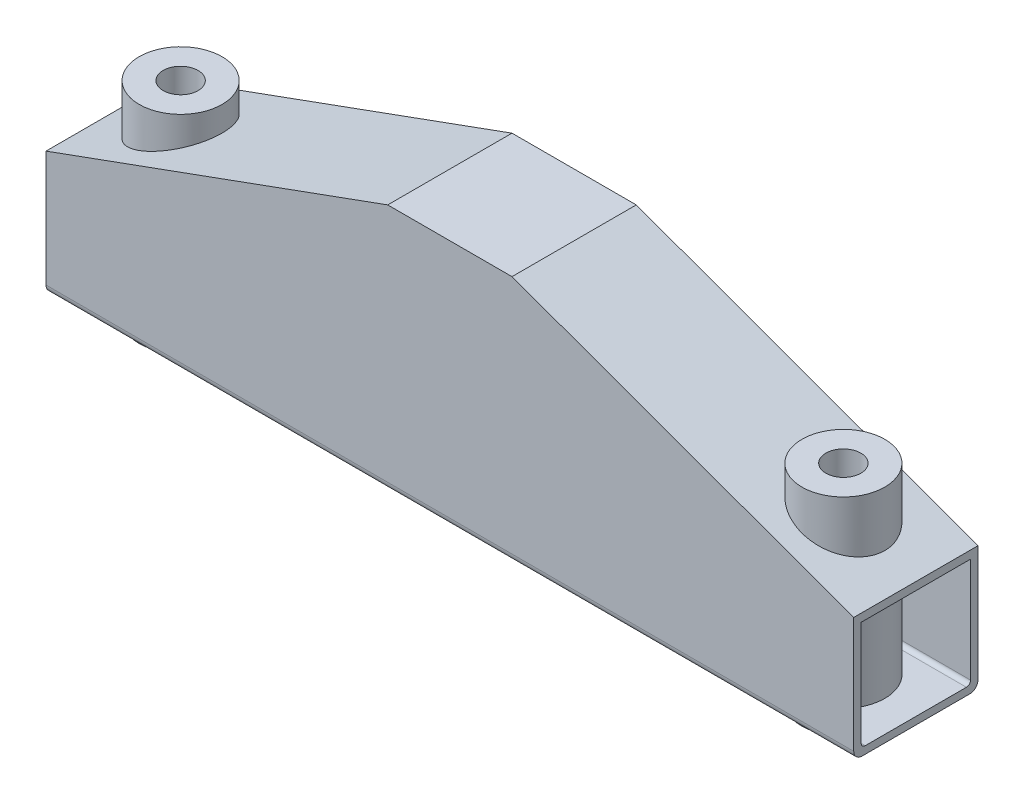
ISO-10303-21;
HEADER;
FILE_DESCRIPTION(('STEP AP214'),'2;1');
FILE_NAME('part.step','',(''),(''),'','','');
FILE_SCHEMA(('AUTOMOTIVE_DESIGN { 1 0 10303 214 1 1 1 1 }'));
ENDSEC;
DATA;
#1=APPLICATION_CONTEXT('core data for automotive mechanical design processes');
#2=APPLICATION_PROTOCOL_DEFINITION('international standard','automotive_design',2000,#1);
#3=PRODUCT_CONTEXT('',#1,'mechanical');
#4=PRODUCT('Part','Part','',(#3));
#5=PRODUCT_RELATED_PRODUCT_CATEGORY('part','',(#4));
#6=PRODUCT_DEFINITION_FORMATION('','',#4);
#7=PRODUCT_DEFINITION_CONTEXT('part definition',#1,'design');
#8=PRODUCT_DEFINITION('design','',#6,#7);
#9=PRODUCT_DEFINITION_SHAPE('','',#8);
#10=(LENGTH_UNIT() NAMED_UNIT(*) SI_UNIT(.MILLI.,.METRE.));
#11=(NAMED_UNIT(*) PLANE_ANGLE_UNIT() SI_UNIT($,.RADIAN.));
#12=(NAMED_UNIT(*) SI_UNIT($,.STERADIAN.) SOLID_ANGLE_UNIT());
#13=UNCERTAINTY_MEASURE_WITH_UNIT(LENGTH_MEASURE(1.E-05),#10,'distance_accuracy_value','');
#14=(GEOMETRIC_REPRESENTATION_CONTEXT(3) GLOBAL_UNCERTAINTY_ASSIGNED_CONTEXT((#13)) GLOBAL_UNIT_ASSIGNED_CONTEXT((#10,
#11,#12)) REPRESENTATION_CONTEXT('',''));
#15=CARTESIAN_POINT('',(0.,0.,0.));
#16=DIRECTION('',(0.,0.,1.));
#17=DIRECTION('',(1.,0.,0.));
#18=AXIS2_PLACEMENT_3D('',#15,#16,#17);
#19=CARTESIAN_POINT('',(-19.05,36.83,-25.4));
#20=DIRECTION('',(0.341743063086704,-0.939793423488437,0.));
#21=DIRECTION('',(0.939793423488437,0.341743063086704,0.));
#22=AXIS2_PLACEMENT_3D('',#19,#20,#21);
#23=PLANE('',#22);
#24=DIRECTION('',(0.,0.,1.));
#25=VECTOR('',#24,1.);
#26=CARTESIAN_POINT('',(-19.05,36.83,-25.4));
#27=LINE('',#26,#25);
#28=CARTESIAN_POINT('',(-19.05,36.83,-19.05));
#29=VERTEX_POINT('',#28);
#30=CARTESIAN_POINT('',(-19.05,36.83,19.05));
#31=VERTEX_POINT('',#30);
#32=EDGE_CURVE('E286',#29,#31,#27,.T.);
#33=ORIENTED_EDGE('',*,*,#32,.F.);
#34=DIRECTION('',(0.939793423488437,0.341743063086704,0.));
#35=VECTOR('',#34,1.);
#36=CARTESIAN_POINT('',(83.4816423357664,74.1142335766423,-19.05));
#37=LINE('',#36,#35);
#38=CARTESIAN_POINT('',(-123.825,-1.27000000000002,-19.05));
#39=VERTEX_POINT('',#38);
#40=EDGE_CURVE('E289',#39,#29,#37,.T.);
#41=ORIENTED_EDGE('',*,*,#40,.F.);
#42=DIRECTION('',(0.,0.,-1.));
#43=VECTOR('',#42,1.);
#44=CARTESIAN_POINT('',(-123.825,-1.27000000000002,16.51));
#45=LINE('',#44,#43);
#46=CARTESIAN_POINT('',(-123.825,-1.27000000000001,19.05));
#47=VERTEX_POINT('',#46);
#48=EDGE_CURVE('E230',#47,#39,#45,.T.);
#49=ORIENTED_EDGE('',*,*,#48,.F.);
#50=DIRECTION('',(-0.939793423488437,-0.341743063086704,0.));
#51=VECTOR('',#50,1.);
#52=CARTESIAN_POINT('',(107.138868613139,82.7168613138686,19.05));
#53=LINE('',#52,#51);
#54=EDGE_CURVE('E185',#31,#47,#53,.T.);
#55=ORIENTED_EDGE('',*,*,#54,.F.);
#56=EDGE_LOOP('',(#33,#41,#49,#55));
#57=FACE_BOUND('',#56,.T.);
#58=CARTESIAN_POINT('',(-101.6,6.81181818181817,0.));
#59=DIRECTION('',(0.341743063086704,-0.939793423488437,0.));
#60=DIRECTION('',(-0.939793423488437,-0.341743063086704,0.));
#61=AXIS2_PLACEMENT_3D('',#58,#59,#60);
#62=ELLIPSE('',#61,13.5136080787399,12.7);
#63=CARTESIAN_POINT('',(-114.3,2.19363636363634,0.));
#64=VERTEX_POINT('',#63);
#65=EDGE_CURVE('E11',#64,#64,#62,.F.);
#66=ORIENTED_EDGE('',*,*,#65,.F.);
#67=EDGE_LOOP('',(#66));
#68=FACE_BOUND('',#67,.T.);
#69=ADVANCED_FACE('F35',(#57,#68),#23,.F.);
#70=CARTESIAN_POINT('',(-123.825,-3.7024494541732,19.05));
#71=DIRECTION('',(-0.341743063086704,0.939793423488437,0.));
#72=DIRECTION('',(-0.939793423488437,-0.341743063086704,0.));
#73=AXIS2_PLACEMENT_3D('',#70,#71,#72);
#74=PLANE('',#73);
#75=DIRECTION('',(0.,0.,-1.));
#76=VECTOR('',#75,1.);
#77=CARTESIAN_POINT('',(-123.825,-3.7024494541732,19.05));
#78=LINE('',#77,#76);
#79=CARTESIAN_POINT('',(-123.825,-3.7024494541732,16.764));
#80=VERTEX_POINT('',#79);
#81=CARTESIAN_POINT('',(-123.825,-3.7024494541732,-16.764));
#82=VERTEX_POINT('',#81);
#83=EDGE_CURVE('E270',#80,#82,#78,.T.);
#84=ORIENTED_EDGE('',*,*,#83,.T.);
#85=DIRECTION('',(0.939793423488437,0.341743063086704,0.));
#86=VECTOR('',#85,1.);
#87=CARTESIAN_POINT('',(107.920093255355,80.5684935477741,-16.764));
#88=LINE('',#87,#86);
#89=CARTESIAN_POINT('',(-18.6472640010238,34.544,-16.764));
#90=VERTEX_POINT('',#89);
#91=EDGE_CURVE('E167',#82,#90,#88,.T.);
#92=ORIENTED_EDGE('',*,*,#91,.T.);
#93=DIRECTION('',(0.,0.,-1.));
#94=VECTOR('',#93,1.);
#95=CARTESIAN_POINT('',(-18.6472640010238,34.544,19.05));
#96=LINE('',#95,#94);
#97=CARTESIAN_POINT('',(-18.6472640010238,34.544,16.764));
#98=VERTEX_POINT('',#97);
#99=EDGE_CURVE('E267',#98,#90,#96,.T.);
#100=ORIENTED_EDGE('',*,*,#99,.F.);
#101=DIRECTION('',(-0.939793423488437,-0.341743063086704,0.));
#102=VECTOR('',#101,1.);
#103=CARTESIAN_POINT('',(84.5891735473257,72.0845227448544,16.764));
#104=LINE('',#103,#102);
#105=EDGE_CURVE('E273',#98,#80,#104,.T.);
#106=ORIENTED_EDGE('',*,*,#105,.T.);
#107=EDGE_LOOP('',(#84,#92,#100,#106));
#108=FACE_BOUND('',#107,.T.);
#109=CARTESIAN_POINT('',(-101.6,4.37936872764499,0.));
#110=DIRECTION('',(-0.341743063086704,0.939793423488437,0.));
#111=DIRECTION('',(0.939793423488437,0.341743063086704,0.));
#112=AXIS2_PLACEMENT_3D('',#109,#110,#111);
#113=ELLIPSE('',#112,13.5136080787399,12.7);
#114=CARTESIAN_POINT('',(-88.9,8.99755054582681,0.));
#115=VERTEX_POINT('',#114);
#116=EDGE_CURVE('E39',#115,#115,#113,.T.);
#117=ORIENTED_EDGE('',*,*,#116,.T.);
#118=EDGE_LOOP('',(#117));
#119=FACE_BOUND('',#118,.T.);
#120=ADVANCED_FACE('F324',(#108,#119),#74,.F.);
#121=CARTESIAN_POINT('',(123.825,-1.27000000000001,-25.4));
#122=DIRECTION('',(-0.341743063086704,-0.939793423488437,0.));
#123=DIRECTION('',(0.939793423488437,-0.341743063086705,0.));
#124=AXIS2_PLACEMENT_3D('',#121,#122,#123);
#125=PLANE('',#124);
#126=DIRECTION('',(-0.939793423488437,0.341743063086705,0.));
#127=VECTOR('',#126,1.);
#128=CARTESIAN_POINT('',(111.588503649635,3.17963503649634,19.05));
#129=LINE('',#128,#127);
#130=CARTESIAN_POINT('',(123.825,-1.27000000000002,19.05));
#131=VERTEX_POINT('',#130);
#132=CARTESIAN_POINT('',(19.05,36.83,19.05));
#133=VERTEX_POINT('',#132);
#134=EDGE_CURVE('E283',#131,#133,#129,.T.);
#135=ORIENTED_EDGE('',*,*,#134,.F.);
#136=DIRECTION('',(0.,0.,-1.));
#137=VECTOR('',#136,1.);
#138=CARTESIAN_POINT('',(123.825,-1.27000000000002,16.51));
#139=LINE('',#138,#137);
#140=CARTESIAN_POINT('',(123.825,-1.27000000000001,-19.05));
#141=VERTEX_POINT('',#140);
#142=EDGE_CURVE('E233',#131,#141,#139,.T.);
#143=ORIENTED_EDGE('',*,*,#142,.T.);
#144=DIRECTION('',(0.939793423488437,-0.341743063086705,0.));
#145=VECTOR('',#144,1.);
#146=CARTESIAN_POINT('',(135.245729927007,-5.42299270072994,-19.05));
#147=LINE('',#146,#145);
#148=CARTESIAN_POINT('',(19.05,36.83,-19.05));
#149=VERTEX_POINT('',#148);
#150=EDGE_CURVE('E280',#149,#141,#147,.T.);
#151=ORIENTED_EDGE('',*,*,#150,.F.);
#152=DIRECTION('',(0.,0.,1.));
#153=VECTOR('',#152,1.);
#154=CARTESIAN_POINT('',(19.05,36.83,-25.4));
#155=LINE('',#154,#153);
#156=EDGE_CURVE('E278',#149,#133,#155,.T.);
#157=ORIENTED_EDGE('',*,*,#156,.T.);
#158=EDGE_LOOP('',(#135,#143,#151,#157));
#159=FACE_BOUND('',#158,.T.);
#160=CARTESIAN_POINT('',(101.6,6.81181818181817,0.));
#161=DIRECTION('',(-0.341743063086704,-0.939793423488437,0.));
#162=DIRECTION('',(0.939793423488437,-0.341743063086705,0.));
#163=AXIS2_PLACEMENT_3D('',#160,#161,#162);
#164=ELLIPSE('',#163,13.5136080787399,12.7);
#165=CARTESIAN_POINT('',(114.3,2.19363636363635,0.));
#166=VERTEX_POINT('',#165);
#167=EDGE_CURVE('E44',#166,#166,#164,.F.);
#168=ORIENTED_EDGE('',*,*,#167,.F.);
#169=EDGE_LOOP('',(#168));
#170=FACE_BOUND('',#169,.T.);
#171=ADVANCED_FACE('F348',(#159,#170),#125,.F.);
#172=CARTESIAN_POINT('',(18.6472640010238,34.544,19.05));
#173=DIRECTION('',(0.341743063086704,0.939793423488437,0.));
#174=DIRECTION('',(-0.939793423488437,0.341743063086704,0.));
#175=AXIS2_PLACEMENT_3D('',#172,#173,#174);
#176=PLANE('',#175);
#177=DIRECTION('',(0.,0.,-1.));
#178=VECTOR('',#177,1.);
#179=CARTESIAN_POINT('',(18.6472640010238,34.544,19.05));
#180=LINE('',#179,#178);
#181=CARTESIAN_POINT('',(18.6472640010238,34.544,16.764));
#182=VERTEX_POINT('',#181);
#183=CARTESIAN_POINT('',(18.6472640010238,34.544,-16.764));
#184=VERTEX_POINT('',#183);
#185=EDGE_CURVE('E156',#182,#184,#180,.T.);
#186=ORIENTED_EDGE('',*,*,#185,.T.);
#187=DIRECTION('',(0.939793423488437,-0.341743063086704,0.));
#188=VECTOR('',#187,1.);
#189=CARTESIAN_POINT('',(110.807279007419,1.03126727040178,-16.764));
#190=LINE('',#189,#188);
#191=CARTESIAN_POINT('',(123.825,-3.7024494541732,-16.764));
#192=VERTEX_POINT('',#191);
#193=EDGE_CURVE('E57',#184,#192,#190,.T.);
#194=ORIENTED_EDGE('',*,*,#193,.T.);
#195=DIRECTION('',(0.,0.,-1.));
#196=VECTOR('',#195,1.);
#197=CARTESIAN_POINT('',(123.825,-3.7024494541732,19.05));
#198=LINE('',#197,#196);
#199=CARTESIAN_POINT('',(123.825,-3.7024494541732,16.764));
#200=VERTEX_POINT('',#199);
#201=EDGE_CURVE('E147',#200,#192,#198,.T.);
#202=ORIENTED_EDGE('',*,*,#201,.F.);
#203=DIRECTION('',(-0.939793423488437,0.341743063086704,0.));
#204=VECTOR('',#203,1.);
#205=CARTESIAN_POINT('',(134.138198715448,-7.45270353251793,16.764));
#206=LINE('',#205,#204);
#207=EDGE_CURVE('E152',#200,#182,#206,.T.);
#208=ORIENTED_EDGE('',*,*,#207,.T.);
#209=EDGE_LOOP('',(#186,#194,#202,#208));
#210=FACE_BOUND('',#209,.T.);
#211=CARTESIAN_POINT('',(101.6,4.37936872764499,0.));
#212=DIRECTION('',(0.341743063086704,0.939793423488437,0.));
#213=DIRECTION('',(-0.939793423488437,0.341743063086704,0.));
#214=AXIS2_PLACEMENT_3D('',#211,#212,#213);
#215=ELLIPSE('',#214,13.5136080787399,12.7);
#216=CARTESIAN_POINT('',(88.9,8.99755054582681,0.));
#217=VERTEX_POINT('',#216);
#218=EDGE_CURVE('E236',#217,#217,#215,.T.);
#219=ORIENTED_EDGE('',*,*,#218,.T.);
#220=EDGE_LOOP('',(#219));
#221=FACE_BOUND('',#220,.T.);
#222=ADVANCED_FACE('F150',(#210,#221),#176,.F.);
#223=CARTESIAN_POINT('',(123.825,36.83,-16.764));
#224=DIRECTION('',(0.,0.,-1.));
#225=DIRECTION('',(0.,1.,0.));
#226=AXIS2_PLACEMENT_3D('',#223,#224,#225);
#227=PLANE('',#226);
#228=ORIENTED_EDGE('',*,*,#91,.F.);
#229=DIRECTION('',(0.,-1.,0.));
#230=VECTOR('',#229,1.);
#231=CARTESIAN_POINT('',(-123.825,36.83,-16.764));
#232=LINE('',#231,#230);
#233=CARTESIAN_POINT('',(-123.825,-35.814,-16.764));
#234=VERTEX_POINT('',#233);
#235=EDGE_CURVE('E193',#82,#234,#232,.T.);
#236=ORIENTED_EDGE('',*,*,#235,.T.);
#237=DIRECTION('',(-1.,0.,0.));
#238=VECTOR('',#237,1.);
#239=CARTESIAN_POINT('',(123.825,-35.814,-16.764));
#240=LINE('',#239,#238);
#241=CARTESIAN_POINT('',(123.825,-35.814,-16.764));
#242=VERTEX_POINT('',#241);
#243=EDGE_CURVE('E210',#242,#234,#240,.T.);
#244=ORIENTED_EDGE('',*,*,#243,.F.);
#245=DIRECTION('',(0.,-1.,0.));
#246=VECTOR('',#245,1.);
#247=CARTESIAN_POINT('',(123.825,36.83,-16.764));
#248=LINE('',#247,#246);
#249=EDGE_CURVE('E303',#192,#242,#248,.T.);
#250=ORIENTED_EDGE('',*,*,#249,.F.);
#251=ORIENTED_EDGE('',*,*,#193,.F.);
#252=DIRECTION('',(1.,0.,0.));
#253=VECTOR('',#252,1.);
#254=CARTESIAN_POINT('',(123.825,34.544,-16.764));
#255=LINE('',#254,#253);
#256=EDGE_CURVE('E52',#90,#184,#255,.T.);
#257=ORIENTED_EDGE('',*,*,#256,.F.);
#258=EDGE_LOOP('',(#228,#236,#244,#250,#251,#257));
#259=FACE_BOUND('',#258,.T.);
#260=ADVANCED_FACE('F356',(#259),#227,.F.);
#261=CARTESIAN_POINT('',(123.825,-35.814,16.764));
#262=DIRECTION('',(0.,0.,1.));
#263=DIRECTION('',(1.,0.,0.));
#264=AXIS2_PLACEMENT_3D('',#261,#262,#263);
#265=PLANE('',#264);
#266=ORIENTED_EDGE('',*,*,#105,.F.);
#267=DIRECTION('',(-1.,0.,0.));
#268=VECTOR('',#267,1.);
#269=CARTESIAN_POINT('',(123.825,34.544,16.764));
#270=LINE('',#269,#268);
#271=EDGE_CURVE('E166',#182,#98,#270,.T.);
#272=ORIENTED_EDGE('',*,*,#271,.F.);
#273=ORIENTED_EDGE('',*,*,#207,.F.);
#274=DIRECTION('',(0.,1.,0.));
#275=VECTOR('',#274,1.);
#276=CARTESIAN_POINT('',(123.825,-35.814,16.764));
#277=LINE('',#276,#275);
#278=CARTESIAN_POINT('',(123.825,-35.814,16.764));
#279=VERTEX_POINT('',#278);
#280=EDGE_CURVE('E165',#279,#200,#277,.T.);
#281=ORIENTED_EDGE('',*,*,#280,.F.);
#282=DIRECTION('',(-1.,0.,0.));
#283=VECTOR('',#282,1.);
#284=CARTESIAN_POINT('',(123.825,-35.814,16.764));
#285=LINE('',#284,#283);
#286=CARTESIAN_POINT('',(-123.825,-35.814,16.764));
#287=VERTEX_POINT('',#286);
#288=EDGE_CURVE('E174',#279,#287,#285,.T.);
#289=ORIENTED_EDGE('',*,*,#288,.T.);
#290=DIRECTION('',(0.,1.,0.));
#291=VECTOR('',#290,1.);
#292=CARTESIAN_POINT('',(-123.825,-35.814,16.764));
#293=LINE('',#292,#291);
#294=EDGE_CURVE('E201',#287,#80,#293,.T.);
#295=ORIENTED_EDGE('',*,*,#294,.T.);
#296=EDGE_LOOP('',(#266,#272,#273,#281,#289,#295));
#297=FACE_BOUND('',#296,.T.);
#298=ADVANCED_FACE('F163',(#297),#265,.F.);
#299=CARTESIAN_POINT('',(123.825,36.83,19.05));
#300=DIRECTION('',(0.,0.,-1.));
#301=DIRECTION('',(0.,1.,0.));
#302=AXIS2_PLACEMENT_3D('',#299,#300,#301);
#303=PLANE('',#302);
#304=DIRECTION('',(0.,-1.,0.));
#305=VECTOR('',#304,1.);
#306=CARTESIAN_POINT('',(-123.825,36.83,19.05));
#307=LINE('',#306,#305);
#308=CARTESIAN_POINT('',(-123.825,-36.83,19.05));
#309=VERTEX_POINT('',#308);
#310=EDGE_CURVE('E182',#47,#309,#307,.T.);
#311=ORIENTED_EDGE('',*,*,#310,.T.);
#312=DIRECTION('',(-1.,0.,0.));
#313=VECTOR('',#312,1.);
#314=CARTESIAN_POINT('',(123.825,-36.83,19.05));
#315=LINE('',#314,#313);
#316=CARTESIAN_POINT('',(123.825,-36.83,19.05));
#317=VERTEX_POINT('',#316);
#318=EDGE_CURVE('E225',#317,#309,#315,.T.);
#319=ORIENTED_EDGE('',*,*,#318,.F.);
#320=DIRECTION('',(0.,-1.,0.));
#321=VECTOR('',#320,1.);
#322=CARTESIAN_POINT('',(123.825,36.83,19.05));
#323=LINE('',#322,#321);
#324=EDGE_CURVE('E203',#131,#317,#323,.T.);
#325=ORIENTED_EDGE('',*,*,#324,.F.);
#326=ORIENTED_EDGE('',*,*,#134,.T.);
#327=DIRECTION('',(-1.,0.,0.));
#328=VECTOR('',#327,1.);
#329=CARTESIAN_POINT('',(123.825,36.83,19.05));
#330=LINE('',#329,#328);
#331=EDGE_CURVE('E228',#133,#31,#330,.T.);
#332=ORIENTED_EDGE('',*,*,#331,.T.);
#333=ORIENTED_EDGE('',*,*,#54,.T.);
#334=EDGE_LOOP('',(#311,#319,#325,#326,#332,#333));
#335=FACE_BOUND('',#334,.T.);
#336=ADVANCED_FACE('F37',(#335),#303,.F.);
#337=CARTESIAN_POINT('',(123.825,-36.83,16.51));
#338=DIRECTION('',(-1.,0.,0.));
#339=DIRECTION('',(0.,0.,1.));
#340=AXIS2_PLACEMENT_3D('',#337,#338,#339);
#341=CYLINDRICAL_SURFACE('',#340,2.54);
#342=CARTESIAN_POINT('',(-123.825,-36.83,16.51));
#343=DIRECTION('',(1.,0.,0.));
#344=DIRECTION('',(0.,0.,-1.));
#345=AXIS2_PLACEMENT_3D('',#342,#343,#344);
#346=CIRCLE('',#345,2.54);
#347=CARTESIAN_POINT('',(-123.825,-39.37,16.51));
#348=VERTEX_POINT('',#347);
#349=EDGE_CURVE('E184',#309,#348,#346,.T.);
#350=ORIENTED_EDGE('',*,*,#349,.T.);
#351=DIRECTION('',(-1.,0.,0.));
#352=VECTOR('',#351,1.);
#353=CARTESIAN_POINT('',(123.825,-39.37,16.51));
#354=LINE('',#353,#352);
#355=CARTESIAN_POINT('',(123.825,-39.37,16.51));
#356=VERTEX_POINT('',#355);
#357=EDGE_CURVE('E222',#356,#348,#354,.T.);
#358=ORIENTED_EDGE('',*,*,#357,.F.);
#359=CARTESIAN_POINT('',(123.825,-36.83,16.51));
#360=DIRECTION('',(1.,0.,0.));
#361=DIRECTION('',(0.,0.,-1.));
#362=AXIS2_PLACEMENT_3D('',#359,#360,#361);
#363=CIRCLE('',#362,2.54);
#364=EDGE_CURVE('E295',#317,#356,#363,.T.);
#365=ORIENTED_EDGE('',*,*,#364,.F.);
#366=ORIENTED_EDGE('',*,*,#318,.T.);
#367=EDGE_LOOP('',(#350,#358,#365,#366));
#368=FACE_BOUND('',#367,.T.);
#369=ADVANCED_FACE('F382',(#368),#341,.T.);
#370=CARTESIAN_POINT('',(123.825,-39.37,16.51));
#371=DIRECTION('',(0.,1.,0.));
#372=DIRECTION('',(0.,0.,1.));
#373=AXIS2_PLACEMENT_3D('',#370,#371,#372);
#374=PLANE('',#373);
#375=CARTESIAN_POINT('',(-101.6,-39.37,0.));
#376=DIRECTION('',(0.,1.,0.));
#377=DIRECTION('',(0.,0.,1.));
#378=AXIS2_PLACEMENT_3D('',#375,#376,#377);
#379=CIRCLE('',#378,12.7);
#380=CARTESIAN_POINT('',(-101.6,-39.37,12.7));
#381=VERTEX_POINT('',#380);
#382=EDGE_CURVE('E255',#381,#381,#379,.T.);
#383=ORIENTED_EDGE('',*,*,#382,.T.);
#384=EDGE_LOOP('',(#383));
#385=FACE_BOUND('',#384,.T.);
#386=CARTESIAN_POINT('',(101.6,-39.37,0.));
#387=DIRECTION('',(0.,1.,0.));
#388=DIRECTION('',(0.,0.,1.));
#389=AXIS2_PLACEMENT_3D('',#386,#387,#388);
#390=CIRCLE('',#389,12.7);
#391=CARTESIAN_POINT('',(101.6,-39.37,12.7));
#392=VERTEX_POINT('',#391);
#393=EDGE_CURVE('E157',#392,#392,#390,.T.);
#394=ORIENTED_EDGE('',*,*,#393,.T.);
#395=EDGE_LOOP('',(#394));
#396=FACE_BOUND('',#395,.T.);
#397=DIRECTION('',(0.,0.,-1.));
#398=VECTOR('',#397,1.);
#399=CARTESIAN_POINT('',(-123.825,-39.37,16.51));
#400=LINE('',#399,#398);
#401=CARTESIAN_POINT('',(-123.825,-39.37,-16.51));
#402=VERTEX_POINT('',#401);
#403=EDGE_CURVE('E187',#348,#402,#400,.T.);
#404=ORIENTED_EDGE('',*,*,#403,.T.);
#405=DIRECTION('',(-1.,0.,0.));
#406=VECTOR('',#405,1.);
#407=CARTESIAN_POINT('',(123.825,-39.37,-16.51));
#408=LINE('',#407,#406);
#409=CARTESIAN_POINT('',(123.825,-39.37,-16.51));
#410=VERTEX_POINT('',#409);
#411=EDGE_CURVE('E219',#410,#402,#408,.T.);
#412=ORIENTED_EDGE('',*,*,#411,.F.);
#413=DIRECTION('',(0.,0.,-1.));
#414=VECTOR('',#413,1.);
#415=CARTESIAN_POINT('',(123.825,-39.37,16.51));
#416=LINE('',#415,#414);
#417=EDGE_CURVE('E297',#356,#410,#416,.T.);
#418=ORIENTED_EDGE('',*,*,#417,.F.);
#419=ORIENTED_EDGE('',*,*,#357,.T.);
#420=EDGE_LOOP('',(#404,#412,#418,#419));
#421=FACE_BOUND('',#420,.T.);
#422=ADVANCED_FACE('F379',(#385,#396,#421),#374,.F.);
#423=CARTESIAN_POINT('',(123.825,-36.83,-16.51));
#424=DIRECTION('',(-1.,0.,0.));
#425=DIRECTION('',(0.,0.,1.));
#426=AXIS2_PLACEMENT_3D('',#423,#424,#425);
#427=CYLINDRICAL_SURFACE('',#426,2.54);
#428=CARTESIAN_POINT('',(-123.825,-36.83,-16.51));
#429=DIRECTION('',(1.,0.,0.));
#430=DIRECTION('',(0.,0.,-1.));
#431=AXIS2_PLACEMENT_3D('',#428,#429,#430);
#432=CIRCLE('',#431,2.54);
#433=CARTESIAN_POINT('',(-123.825,-36.83,-19.05));
#434=VERTEX_POINT('',#433);
#435=EDGE_CURVE('E189',#402,#434,#432,.T.);
#436=ORIENTED_EDGE('',*,*,#435,.T.);
#437=DIRECTION('',(-1.,0.,0.));
#438=VECTOR('',#437,1.);
#439=CARTESIAN_POINT('',(123.825,-36.83,-19.05));
#440=LINE('',#439,#438);
#441=CARTESIAN_POINT('',(123.825,-36.83,-19.05));
#442=VERTEX_POINT('',#441);
#443=EDGE_CURVE('E216',#442,#434,#440,.T.);
#444=ORIENTED_EDGE('',*,*,#443,.F.);
#445=CARTESIAN_POINT('',(123.825,-36.83,-16.51));
#446=DIRECTION('',(1.,0.,0.));
#447=DIRECTION('',(0.,0.,-1.));
#448=AXIS2_PLACEMENT_3D('',#445,#446,#447);
#449=CIRCLE('',#448,2.54);
#450=EDGE_CURVE('E299',#410,#442,#449,.T.);
#451=ORIENTED_EDGE('',*,*,#450,.F.);
#452=ORIENTED_EDGE('',*,*,#411,.T.);
#453=EDGE_LOOP('',(#436,#444,#451,#452));
#454=FACE_BOUND('',#453,.T.);
#455=ADVANCED_FACE('F375',(#454),#427,.T.);
#456=CARTESIAN_POINT('',(123.825,-36.83,-19.05));
#457=DIRECTION('',(0.,0.,1.));
#458=DIRECTION('',(0.,-1.,0.));
#459=AXIS2_PLACEMENT_3D('',#456,#457,#458);
#460=PLANE('',#459);
#461=DIRECTION('',(0.,1.,0.));
#462=VECTOR('',#461,1.);
#463=CARTESIAN_POINT('',(-123.825,-36.83,-19.05));
#464=LINE('',#463,#462);
#465=EDGE_CURVE('E191',#434,#39,#464,.T.);
#466=ORIENTED_EDGE('',*,*,#465,.T.);
#467=ORIENTED_EDGE('',*,*,#40,.T.);
#468=DIRECTION('',(-1.,0.,0.));
#469=VECTOR('',#468,1.);
#470=CARTESIAN_POINT('',(123.825,36.83,-19.05));
#471=LINE('',#470,#469);
#472=EDGE_CURVE('E213',#149,#29,#471,.T.);
#473=ORIENTED_EDGE('',*,*,#472,.F.);
#474=ORIENTED_EDGE('',*,*,#150,.T.);
#475=DIRECTION('',(0.,1.,0.));
#476=VECTOR('',#475,1.);
#477=CARTESIAN_POINT('',(123.825,-36.83,-19.05));
#478=LINE('',#477,#476);
#479=EDGE_CURVE('E301',#442,#141,#478,.T.);
#480=ORIENTED_EDGE('',*,*,#479,.F.);
#481=ORIENTED_EDGE('',*,*,#443,.T.);
#482=EDGE_LOOP('',(#466,#467,#473,#474,#480,#481));
#483=FACE_BOUND('',#482,.T.);
#484=ADVANCED_FACE('F371',(#483),#460,.F.);
#485=CARTESIAN_POINT('',(123.825,36.83,-19.05));
#486=DIRECTION('',(0.,-1.,0.));
#487=DIRECTION('',(0.,0.,-1.));
#488=AXIS2_PLACEMENT_3D('',#485,#486,#487);
#489=PLANE('',#488);
#490=ORIENTED_EDGE('',*,*,#472,.T.);
#491=ORIENTED_EDGE('',*,*,#32,.T.);
#492=ORIENTED_EDGE('',*,*,#331,.F.);
#493=ORIENTED_EDGE('',*,*,#156,.F.);
#494=EDGE_LOOP('',(#490,#491,#492,#493));
#495=FACE_BOUND('',#494,.T.);
#496=ADVANCED_FACE('F365',(#495),#489,.F.);
#497=CARTESIAN_POINT('',(123.825,-35.814,-15.494));
#498=DIRECTION('',(-1.,0.,0.));
#499=DIRECTION('',(0.,0.,1.));
#500=AXIS2_PLACEMENT_3D('',#497,#498,#499);
#501=CYLINDRICAL_SURFACE('',#500,1.27);
#502=CARTESIAN_POINT('',(-123.825,-35.814,-15.494));
#503=DIRECTION('',(-1.,0.,0.));
#504=DIRECTION('',(0.,0.,1.));
#505=AXIS2_PLACEMENT_3D('',#502,#503,#504);
#506=CIRCLE('',#505,1.27);
#507=CARTESIAN_POINT('',(-123.825,-37.084,-15.494));
#508=VERTEX_POINT('',#507);
#509=EDGE_CURVE('E195',#234,#508,#506,.T.);
#510=ORIENTED_EDGE('',*,*,#509,.T.);
#511=DIRECTION('',(-1.,0.,0.));
#512=VECTOR('',#511,1.);
#513=CARTESIAN_POINT('',(123.825,-37.084,-15.494));
#514=LINE('',#513,#512);
#515=CARTESIAN_POINT('',(123.825,-37.084,-15.494));
#516=VERTEX_POINT('',#515);
#517=EDGE_CURVE('E207',#516,#508,#514,.T.);
#518=ORIENTED_EDGE('',*,*,#517,.F.);
#519=CARTESIAN_POINT('',(123.825,-35.814,-15.494));
#520=DIRECTION('',(-1.,0.,0.));
#521=DIRECTION('',(0.,0.,1.));
#522=AXIS2_PLACEMENT_3D('',#519,#520,#521);
#523=CIRCLE('',#522,1.27);
#524=EDGE_CURVE('E305',#242,#516,#523,.T.);
#525=ORIENTED_EDGE('',*,*,#524,.F.);
#526=ORIENTED_EDGE('',*,*,#243,.T.);
#527=EDGE_LOOP('',(#510,#518,#525,#526));
#528=FACE_BOUND('',#527,.T.);
#529=ADVANCED_FACE('F361',(#528),#501,.F.);
#530=CARTESIAN_POINT('',(123.825,-37.084,-15.494));
#531=DIRECTION('',(0.,-1.,0.));
#532=DIRECTION('',(0.,0.,-1.));
#533=AXIS2_PLACEMENT_3D('',#530,#531,#532);
#534=PLANE('',#533);
#535=CARTESIAN_POINT('',(-101.6,-37.084,0.));
#536=DIRECTION('',(0.,-1.,0.));
#537=DIRECTION('',(0.,0.,-1.));
#538=AXIS2_PLACEMENT_3D('',#535,#536,#537);
#539=CIRCLE('',#538,12.7);
#540=CARTESIAN_POINT('',(-101.6,-37.084,-12.7));
#541=VERTEX_POINT('',#540);
#542=EDGE_CURVE('E252',#541,#541,#539,.T.);
#543=ORIENTED_EDGE('',*,*,#542,.T.);
#544=EDGE_LOOP('',(#543));
#545=FACE_BOUND('',#544,.T.);
#546=CARTESIAN_POINT('',(101.6,-37.084,0.));
#547=DIRECTION('',(0.,-1.,0.));
#548=DIRECTION('',(0.,0.,-1.));
#549=AXIS2_PLACEMENT_3D('',#546,#547,#548);
#550=CIRCLE('',#549,12.7);
#551=CARTESIAN_POINT('',(101.6,-37.084,-12.7));
#552=VERTEX_POINT('',#551);
#553=EDGE_CURVE('E261',#552,#552,#550,.T.);
#554=ORIENTED_EDGE('',*,*,#553,.T.);
#555=EDGE_LOOP('',(#554));
#556=FACE_BOUND('',#555,.T.);
#557=DIRECTION('',(0.,0.,1.));
#558=VECTOR('',#557,1.);
#559=CARTESIAN_POINT('',(-123.825,-37.084,-15.494));
#560=LINE('',#559,#558);
#561=CARTESIAN_POINT('',(-123.825,-37.084,15.494));
#562=VERTEX_POINT('',#561);
#563=EDGE_CURVE('E197',#508,#562,#560,.T.);
#564=ORIENTED_EDGE('',*,*,#563,.T.);
#565=DIRECTION('',(-1.,0.,0.));
#566=VECTOR('',#565,1.);
#567=CARTESIAN_POINT('',(123.825,-37.084,15.494));
#568=LINE('',#567,#566);
#569=CARTESIAN_POINT('',(123.825,-37.084,15.494));
#570=VERTEX_POINT('',#569);
#571=EDGE_CURVE('E176',#570,#562,#568,.T.);
#572=ORIENTED_EDGE('',*,*,#571,.F.);
#573=DIRECTION('',(0.,0.,1.));
#574=VECTOR('',#573,1.);
#575=CARTESIAN_POINT('',(123.825,-37.084,-15.494));
#576=LINE('',#575,#574);
#577=EDGE_CURVE('E178',#516,#570,#576,.T.);
#578=ORIENTED_EDGE('',*,*,#577,.F.);
#579=ORIENTED_EDGE('',*,*,#517,.T.);
#580=EDGE_LOOP('',(#564,#572,#578,#579));
#581=FACE_BOUND('',#580,.T.);
#582=ADVANCED_FACE('F311',(#545,#556,#581),#534,.F.);
#583=CARTESIAN_POINT('',(123.825,-35.814,15.494));
#584=DIRECTION('',(-1.,0.,0.));
#585=DIRECTION('',(0.,0.,1.));
#586=AXIS2_PLACEMENT_3D('',#583,#584,#585);
#587=CYLINDRICAL_SURFACE('',#586,1.27);
#588=CARTESIAN_POINT('',(-123.825,-35.814,15.494));
#589=DIRECTION('',(-1.,0.,0.));
#590=DIRECTION('',(0.,0.,1.));
#591=AXIS2_PLACEMENT_3D('',#588,#589,#590);
#592=CIRCLE('',#591,1.27);
#593=EDGE_CURVE('E199',#562,#287,#592,.T.);
#594=ORIENTED_EDGE('',*,*,#593,.T.);
#595=ORIENTED_EDGE('',*,*,#288,.F.);
#596=CARTESIAN_POINT('',(123.825,-35.814,15.494));
#597=DIRECTION('',(-1.,0.,0.));
#598=DIRECTION('',(0.,0.,1.));
#599=AXIS2_PLACEMENT_3D('',#596,#597,#598);
#600=CIRCLE('',#599,1.27);
#601=EDGE_CURVE('E172',#570,#279,#600,.T.);
#602=ORIENTED_EDGE('',*,*,#601,.F.);
#603=ORIENTED_EDGE('',*,*,#571,.T.);
#604=EDGE_LOOP('',(#594,#595,#602,#603));
#605=FACE_BOUND('',#604,.T.);
#606=ADVANCED_FACE('F315',(#605),#587,.F.);
#607=CARTESIAN_POINT('',(123.825,-36.83,16.51));
#608=DIRECTION('',(1.,0.,0.));
#609=DIRECTION('',(0.,0.,-1.));
#610=AXIS2_PLACEMENT_3D('',#607,#608,#609);
#611=PLANE('',#610);
#612=ORIENTED_EDGE('',*,*,#201,.T.);
#613=ORIENTED_EDGE('',*,*,#249,.T.);
#614=ORIENTED_EDGE('',*,*,#524,.T.);
#615=ORIENTED_EDGE('',*,*,#577,.T.);
#616=ORIENTED_EDGE('',*,*,#601,.T.);
#617=ORIENTED_EDGE('',*,*,#280,.T.);
#618=EDGE_LOOP('',(#612,#613,#614,#615,#616,#617));
#619=FACE_BOUND('',#618,.T.);
#620=ORIENTED_EDGE('',*,*,#324,.T.);
#621=ORIENTED_EDGE('',*,*,#364,.T.);
#622=ORIENTED_EDGE('',*,*,#417,.T.);
#623=ORIENTED_EDGE('',*,*,#450,.T.);
#624=ORIENTED_EDGE('',*,*,#479,.T.);
#625=ORIENTED_EDGE('',*,*,#142,.F.);
#626=EDGE_LOOP('',(#620,#621,#622,#623,#624,#625));
#627=FACE_BOUND('',#626,.T.);
#628=ADVANCED_FACE('F169',(#619,#627),#611,.T.);
#629=CARTESIAN_POINT('',(-123.825,-36.83,16.51));
#630=DIRECTION('',(1.,0.,0.));
#631=DIRECTION('',(0.,0.,-1.));
#632=AXIS2_PLACEMENT_3D('',#629,#630,#631);
#633=PLANE('',#632);
#634=ORIENTED_EDGE('',*,*,#235,.F.);
#635=ORIENTED_EDGE('',*,*,#83,.F.);
#636=ORIENTED_EDGE('',*,*,#294,.F.);
#637=ORIENTED_EDGE('',*,*,#593,.F.);
#638=ORIENTED_EDGE('',*,*,#563,.F.);
#639=ORIENTED_EDGE('',*,*,#509,.F.);
#640=EDGE_LOOP('',(#634,#635,#636,#637,#638,#639));
#641=FACE_BOUND('',#640,.T.);
#642=ORIENTED_EDGE('',*,*,#310,.F.);
#643=ORIENTED_EDGE('',*,*,#48,.T.);
#644=ORIENTED_EDGE('',*,*,#465,.F.);
#645=ORIENTED_EDGE('',*,*,#435,.F.);
#646=ORIENTED_EDGE('',*,*,#403,.F.);
#647=ORIENTED_EDGE('',*,*,#349,.F.);
#648=EDGE_LOOP('',(#642,#643,#644,#645,#646,#647));
#649=FACE_BOUND('',#648,.T.);
#650=ADVANCED_FACE('F320',(#641,#649),#633,.F.);
#651=CARTESIAN_POINT('',(-18.6472640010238,34.544,19.05));
#652=DIRECTION('',(0.,1.,0.));
#653=DIRECTION('',(0.,0.,1.));
#654=AXIS2_PLACEMENT_3D('',#651,#652,#653);
#655=PLANE('',#654);
#656=ORIENTED_EDGE('',*,*,#99,.T.);
#657=ORIENTED_EDGE('',*,*,#256,.T.);
#658=ORIENTED_EDGE('',*,*,#185,.F.);
#659=ORIENTED_EDGE('',*,*,#271,.T.);
#660=EDGE_LOOP('',(#656,#657,#658,#659));
#661=FACE_BOUND('',#660,.T.);
#662=ADVANCED_FACE('F327',(#661),#655,.F.);
#663=CARTESIAN_POINT('',(101.6,-44.45,0.));
#664=DIRECTION('',(0.,1.,0.));
#665=DIRECTION('',(0.,0.,1.));
#666=AXIS2_PLACEMENT_3D('',#663,#664,#665);
#667=CYLINDRICAL_SURFACE('',#666,12.7);
#668=ORIENTED_EDGE('',*,*,#218,.F.);
#669=EDGE_LOOP('',(#668));
#670=FACE_BOUND('',#669,.T.);
#671=ORIENTED_EDGE('',*,*,#553,.F.);
#672=EDGE_LOOP('',(#671));
#673=FACE_BOUND('',#672,.T.);
#674=ADVANCED_FACE('F329',(#670,#673),#667,.T.);
#675=CARTESIAN_POINT('',(101.6,-44.45,0.));
#676=DIRECTION('',(0.,1.,0.));
#677=DIRECTION('',(0.,0.,1.));
#678=AXIS2_PLACEMENT_3D('',#675,#676,#677);
#679=CIRCLE('',#678,12.7);
#680=CARTESIAN_POINT('',(101.6,-44.45,12.7));
#681=VERTEX_POINT('',#680);
#682=EDGE_CURVE('E258',#681,#681,#679,.T.);
#683=ORIENTED_EDGE('',*,*,#682,.T.);
#684=EDGE_LOOP('',(#683));
#685=FACE_BOUND('',#684,.T.);
#686=ORIENTED_EDGE('',*,*,#393,.F.);
#687=EDGE_LOOP('',(#686));
#688=FACE_BOUND('',#687,.T.);
#689=ADVANCED_FACE('F335',(#685,#688),#667,.T.);
#690=CARTESIAN_POINT('',(101.6,-44.45,0.));
#691=DIRECTION('',(0.,1.,0.));
#692=DIRECTION('',(0.,0.,1.));
#693=AXIS2_PLACEMENT_3D('',#690,#691,#692);
#694=PLANE('',#693);
#695=CARTESIAN_POINT('',(101.6,-44.45,0.));
#696=DIRECTION('',(0.,1.,0.));
#697=DIRECTION('',(0.,0.,1.));
#698=AXIS2_PLACEMENT_3D('',#695,#696,#697);
#699=CIRCLE('',#698,5.35812999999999);
#700=CARTESIAN_POINT('',(101.6,-44.45,5.35812999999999));
#701=VERTEX_POINT('',#700);
#702=EDGE_CURVE('E475',#701,#701,#699,.T.);
#703=ORIENTED_EDGE('',*,*,#702,.T.);
#704=EDGE_LOOP('',(#703));
#705=FACE_BOUND('',#704,.T.);
#706=ORIENTED_EDGE('',*,*,#682,.F.);
#707=EDGE_LOOP('',(#706));
#708=FACE_BOUND('',#707,.T.);
#709=ADVANCED_FACE('F423',(#705,#708),#694,.F.);
#710=CARTESIAN_POINT('',(-101.6,-44.45,0.));
#711=DIRECTION('',(0.,1.,0.));
#712=DIRECTION('',(0.,0.,1.));
#713=AXIS2_PLACEMENT_3D('',#710,#711,#712);
#714=CYLINDRICAL_SURFACE('',#713,12.7);
#715=ORIENTED_EDGE('',*,*,#116,.F.);
#716=EDGE_LOOP('',(#715));
#717=FACE_BOUND('',#716,.T.);
#718=ORIENTED_EDGE('',*,*,#542,.F.);
#719=EDGE_LOOP('',(#718));
#720=FACE_BOUND('',#719,.T.);
#721=ADVANCED_FACE('F427',(#717,#720),#714,.T.);
#722=CARTESIAN_POINT('',(-101.6,-44.45,0.));
#723=DIRECTION('',(0.,1.,0.));
#724=DIRECTION('',(0.,0.,1.));
#725=AXIS2_PLACEMENT_3D('',#722,#723,#724);
#726=CIRCLE('',#725,12.7);
#727=CARTESIAN_POINT('',(-101.6,-44.45,12.7));
#728=VERTEX_POINT('',#727);
#729=EDGE_CURVE('E249',#728,#728,#726,.T.);
#730=ORIENTED_EDGE('',*,*,#729,.T.);
#731=EDGE_LOOP('',(#730));
#732=FACE_BOUND('',#731,.T.);
#733=ORIENTED_EDGE('',*,*,#382,.F.);
#734=EDGE_LOOP('',(#733));
#735=FACE_BOUND('',#734,.T.);
#736=ADVANCED_FACE('F429',(#732,#735),#714,.T.);
#737=CARTESIAN_POINT('',(-101.6,-44.45,0.));
#738=DIRECTION('',(0.,1.,0.));
#739=DIRECTION('',(0.,0.,1.));
#740=AXIS2_PLACEMENT_3D('',#737,#738,#739);
#741=PLANE('',#740);
#742=CARTESIAN_POINT('',(-101.6,-44.45,0.));
#743=DIRECTION('',(0.,1.,0.));
#744=DIRECTION('',(0.,0.,1.));
#745=AXIS2_PLACEMENT_3D('',#742,#743,#744);
#746=CIRCLE('',#745,5.35812999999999);
#747=CARTESIAN_POINT('',(-101.6,-44.45,5.35812999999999));
#748=VERTEX_POINT('',#747);
#749=EDGE_CURVE('E465',#748,#748,#746,.T.);
#750=ORIENTED_EDGE('',*,*,#749,.T.);
#751=EDGE_LOOP('',(#750));
#752=FACE_BOUND('',#751,.T.);
#753=ORIENTED_EDGE('',*,*,#729,.F.);
#754=EDGE_LOOP('',(#753));
#755=FACE_BOUND('',#754,.T.);
#756=ADVANCED_FACE('F432',(#752,#755),#741,.F.);
#757=CARTESIAN_POINT('',(101.6,19.05,0.));
#758=DIRECTION('',(0.,-1.,0.));
#759=DIRECTION('',(0.,0.,-1.));
#760=AXIS2_PLACEMENT_3D('',#757,#758,#759);
#761=CYLINDRICAL_SURFACE('',#760,12.7);
#762=CARTESIAN_POINT('',(101.6,19.05,0.));
#763=DIRECTION('',(0.,1.,0.));
#764=DIRECTION('',(0.,0.,1.));
#765=AXIS2_PLACEMENT_3D('',#762,#763,#764);
#766=CIRCLE('',#765,12.7);
#767=CARTESIAN_POINT('',(101.6,19.05,12.7));
#768=VERTEX_POINT('',#767);
#769=EDGE_CURVE('E248',#768,#768,#766,.T.);
#770=ORIENTED_EDGE('',*,*,#769,.F.);
#771=EDGE_LOOP('',(#770));
#772=FACE_BOUND('',#771,.T.);
#773=ORIENTED_EDGE('',*,*,#167,.T.);
#774=EDGE_LOOP('',(#773));
#775=FACE_BOUND('',#774,.T.);
#776=ADVANCED_FACE('F436',(#772,#775),#761,.T.);
#777=CARTESIAN_POINT('',(101.6,19.05,0.));
#778=DIRECTION('',(0.,1.,0.));
#779=DIRECTION('',(0.,0.,1.));
#780=AXIS2_PLACEMENT_3D('',#777,#778,#779);
#781=PLANE('',#780);
#782=CARTESIAN_POINT('',(101.6,19.05,0.));
#783=DIRECTION('',(0.,1.,0.));
#784=DIRECTION('',(0.,0.,1.));
#785=AXIS2_PLACEMENT_3D('',#782,#783,#784);
#786=CIRCLE('',#785,5.35812999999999);
#787=CARTESIAN_POINT('',(101.6,19.05,5.35812999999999));
#788=VERTEX_POINT('',#787);
#789=EDGE_CURVE('E470',#788,#788,#786,.T.);
#790=ORIENTED_EDGE('',*,*,#789,.F.);
#791=EDGE_LOOP('',(#790));
#792=FACE_BOUND('',#791,.T.);
#793=ORIENTED_EDGE('',*,*,#769,.T.);
#794=EDGE_LOOP('',(#793));
#795=FACE_BOUND('',#794,.T.);
#796=ADVANCED_FACE('F440',(#792,#795),#781,.T.);
#797=CARTESIAN_POINT('',(-101.6,19.05,0.));
#798=DIRECTION('',(0.,-1.,0.));
#799=DIRECTION('',(0.,0.,-1.));
#800=AXIS2_PLACEMENT_3D('',#797,#798,#799);
#801=CYLINDRICAL_SURFACE('',#800,12.7);
#802=CARTESIAN_POINT('',(-101.6,19.05,0.));
#803=DIRECTION('',(0.,1.,0.));
#804=DIRECTION('',(0.,0.,1.));
#805=AXIS2_PLACEMENT_3D('',#802,#803,#804);
#806=CIRCLE('',#805,12.7);
#807=CARTESIAN_POINT('',(-101.6,19.05,12.7));
#808=VERTEX_POINT('',#807);
#809=EDGE_CURVE('E478',#808,#808,#806,.T.);
#810=ORIENTED_EDGE('',*,*,#809,.F.);
#811=EDGE_LOOP('',(#810));
#812=FACE_BOUND('',#811,.T.);
#813=ORIENTED_EDGE('',*,*,#65,.T.);
#814=EDGE_LOOP('',(#813));
#815=FACE_BOUND('',#814,.T.);
#816=ADVANCED_FACE('F444',(#812,#815),#801,.T.);
#817=CARTESIAN_POINT('',(-101.6,19.05,0.));
#818=DIRECTION('',(0.,1.,0.));
#819=DIRECTION('',(0.,0.,1.));
#820=AXIS2_PLACEMENT_3D('',#817,#818,#819);
#821=PLANE('',#820);
#822=CARTESIAN_POINT('',(-101.6,19.05,0.));
#823=DIRECTION('',(0.,1.,0.));
#824=DIRECTION('',(0.,0.,1.));
#825=AXIS2_PLACEMENT_3D('',#822,#823,#824);
#826=CIRCLE('',#825,5.35812999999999);
#827=CARTESIAN_POINT('',(-101.6,19.05,5.35812999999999));
#828=VERTEX_POINT('',#827);
#829=EDGE_CURVE('E468',#828,#828,#826,.T.);
#830=ORIENTED_EDGE('',*,*,#829,.F.);
#831=EDGE_LOOP('',(#830));
#832=FACE_BOUND('',#831,.T.);
#833=ORIENTED_EDGE('',*,*,#809,.T.);
#834=EDGE_LOOP('',(#833));
#835=FACE_BOUND('',#834,.T.);
#836=ADVANCED_FACE('F448',(#832,#835),#821,.T.);
#837=CARTESIAN_POINT('',(101.6,19.05,0.));
#838=DIRECTION('',(0.,1.,0.));
#839=DIRECTION('',(0.,0.,1.));
#840=AXIS2_PLACEMENT_3D('',#837,#838,#839);
#841=CYLINDRICAL_SURFACE('',#840,5.35812999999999);
#842=ORIENTED_EDGE('',*,*,#702,.F.);
#843=EDGE_LOOP('',(#842));
#844=FACE_BOUND('',#843,.T.);
#845=ORIENTED_EDGE('',*,*,#789,.T.);
#846=EDGE_LOOP('',(#845));
#847=FACE_BOUND('',#846,.T.);
#848=ADVANCED_FACE('F452',(#844,#847),#841,.F.);
#849=CARTESIAN_POINT('',(-101.6,19.05,0.));
#850=DIRECTION('',(0.,1.,0.));
#851=DIRECTION('',(0.,0.,1.));
#852=AXIS2_PLACEMENT_3D('',#849,#850,#851);
#853=CYLINDRICAL_SURFACE('',#852,5.35812999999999);
#854=ORIENTED_EDGE('',*,*,#749,.F.);
#855=EDGE_LOOP('',(#854));
#856=FACE_BOUND('',#855,.T.);
#857=ORIENTED_EDGE('',*,*,#829,.T.);
#858=EDGE_LOOP('',(#857));
#859=FACE_BOUND('',#858,.T.);
#860=ADVANCED_FACE('F456',(#856,#859),#853,.F.);
#861=CLOSED_SHELL('',(#69,#120,#171,#222,#260,#298,#336,#369,#422,#455,#484,#496,#529,#582,#606,
#628,#650,#662,#674,#689,#709,#721,#736,#756,#776,#796,#816,#836,#848,#860));
#862=MANIFOLD_SOLID_BREP('B2',#861);
#863=ADVANCED_BREP_SHAPE_REPRESENTATION('',(#18,#862),#14);
#864=SHAPE_DEFINITION_REPRESENTATION(#9,#863);
ENDSEC;
END-ISO-10303-21;
